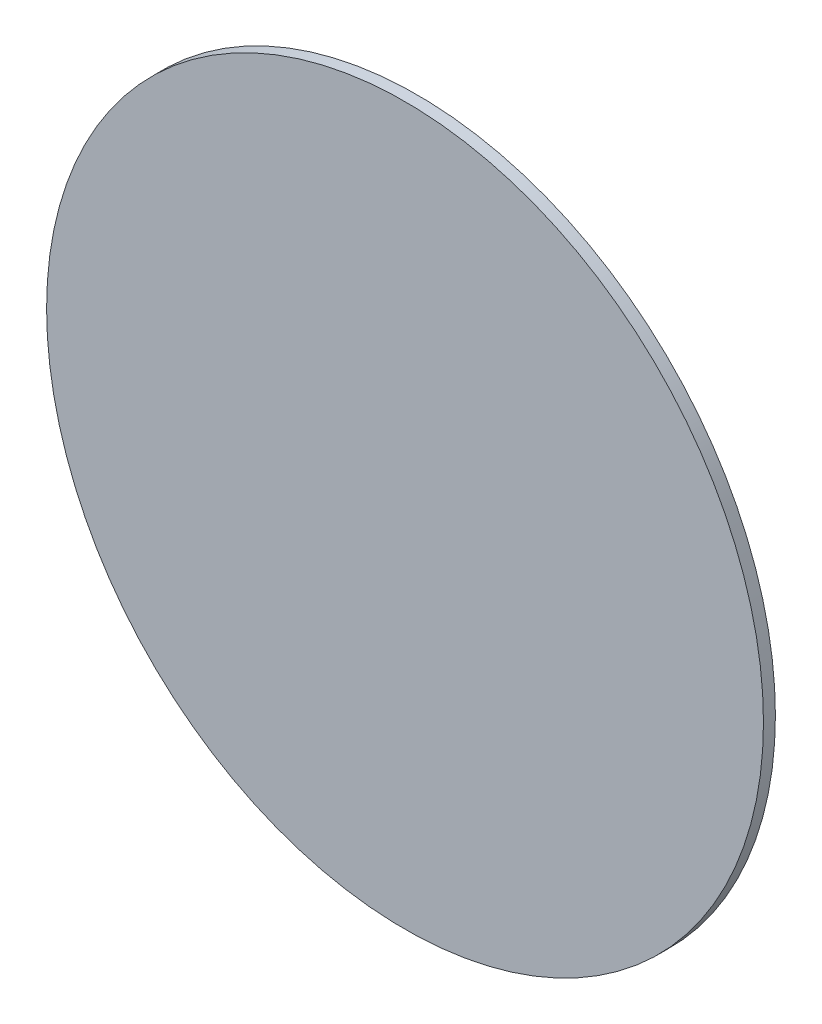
from build123d import *

# Parameters (mm, degrees)
SKETCH1_R           = 381
BOSS_EXTRUDE1_DEPTH = 12.7


with BuildPart() as part:
    # Sketch1 → Boss-Extrude1 (new body)
    with BuildSketch(Plane.XY):
        Circle(SKETCH1_R)
    extrude(amount=BOSS_EXTRUDE1_DEPTH)


solid = part.part
